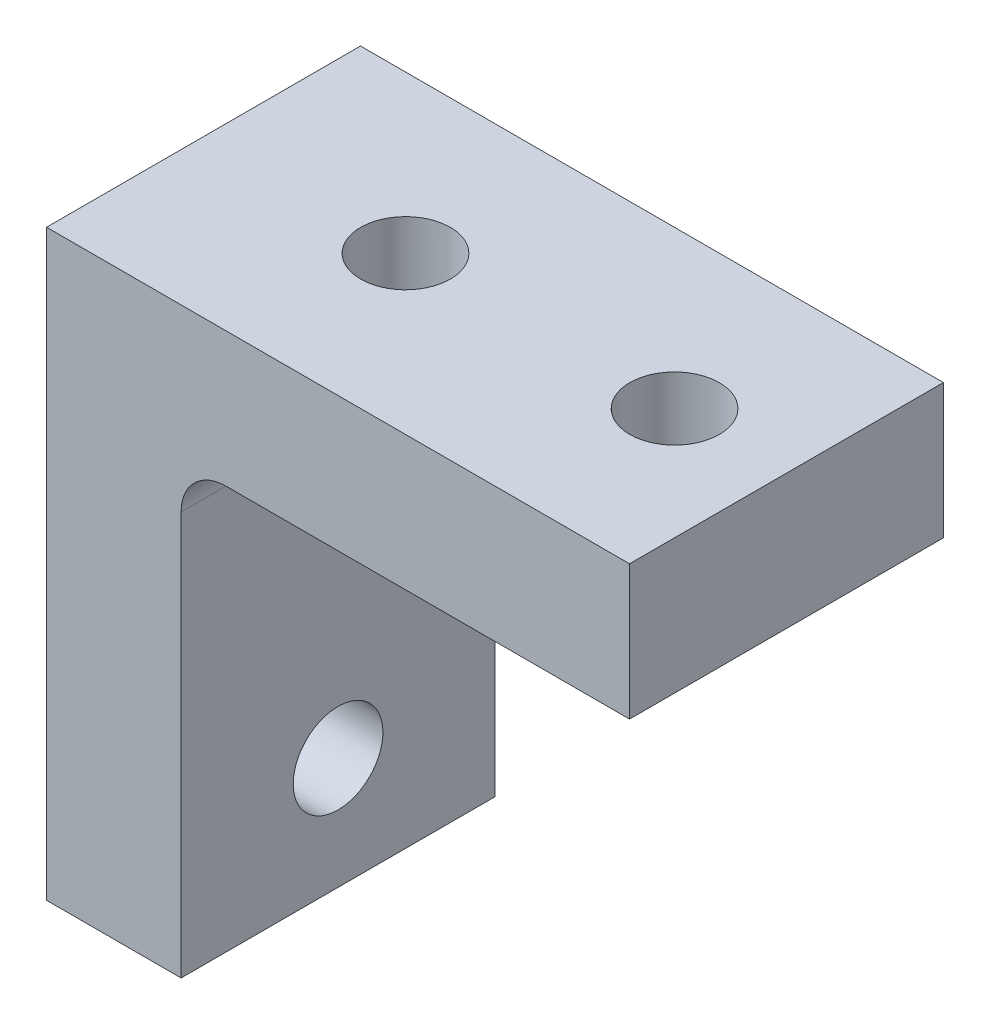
ISO-10303-21;
HEADER;
FILE_DESCRIPTION(('STEP AP214'),'2;1');
FILE_NAME('part.step','',(''),(''),'','','');
FILE_SCHEMA(('AUTOMOTIVE_DESIGN { 1 0 10303 214 1 1 1 1 }'));
ENDSEC;
DATA;
#1=APPLICATION_CONTEXT('core data for automotive mechanical design processes');
#2=APPLICATION_PROTOCOL_DEFINITION('international standard','automotive_design',2000,#1);
#3=PRODUCT_CONTEXT('',#1,'mechanical');
#4=PRODUCT('Part','Part','',(#3));
#5=PRODUCT_RELATED_PRODUCT_CATEGORY('part','',(#4));
#6=PRODUCT_DEFINITION_FORMATION('','',#4);
#7=PRODUCT_DEFINITION_CONTEXT('part definition',#1,'design');
#8=PRODUCT_DEFINITION('design','',#6,#7);
#9=PRODUCT_DEFINITION_SHAPE('','',#8);
#10=(LENGTH_UNIT() NAMED_UNIT(*) SI_UNIT(.MILLI.,.METRE.));
#11=(NAMED_UNIT(*) PLANE_ANGLE_UNIT() SI_UNIT($,.RADIAN.));
#12=(NAMED_UNIT(*) SI_UNIT($,.STERADIAN.) SOLID_ANGLE_UNIT());
#13=UNCERTAINTY_MEASURE_WITH_UNIT(LENGTH_MEASURE(1.E-05),#10,'distance_accuracy_value','');
#14=(GEOMETRIC_REPRESENTATION_CONTEXT(3) GLOBAL_UNCERTAINTY_ASSIGNED_CONTEXT((#13)) GLOBAL_UNIT_ASSIGNED_CONTEXT((#10,
#11,#12)) REPRESENTATION_CONTEXT('',''));
#15=CARTESIAN_POINT('',(0.,0.,0.));
#16=DIRECTION('',(0.,0.,1.));
#17=DIRECTION('',(1.,0.,0.));
#18=AXIS2_PLACEMENT_3D('',#15,#16,#17);
#19=CARTESIAN_POINT('',(0.,0.,11.1125));
#20=DIRECTION('',(1.,0.,0.));
#21=DIRECTION('',(0.,1.,0.));
#22=AXIS2_PLACEMENT_3D('',#19,#20,#21);
#23=PLANE('',#22);
#24=CARTESIAN_POINT('',(0.,-33.3502,0.));
#25=DIRECTION('',(-1.,0.,0.));
#26=DIRECTION('',(0.,0.,1.));
#27=AXIS2_PLACEMENT_3D('',#24,#25,#26);
#28=CIRCLE('',#27,3.17499999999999);
#29=CARTESIAN_POINT('',(0.,-33.3502,3.17499999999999));
#30=VERTEX_POINT('',#29);
#31=EDGE_CURVE('E180',#30,#30,#28,.T.);
#32=ORIENTED_EDGE('',*,*,#31,.F.);
#33=EDGE_LOOP('',(#32));
#34=FACE_BOUND('',#33,.T.);
#35=CARTESIAN_POINT('',(0.,-14.3002,0.));
#36=DIRECTION('',(-1.,0.,0.));
#37=DIRECTION('',(0.,0.,1.));
#38=AXIS2_PLACEMENT_3D('',#35,#36,#37);
#39=CIRCLE('',#38,3.17499999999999);
#40=CARTESIAN_POINT('',(0.,-14.3002,3.17499999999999));
#41=VERTEX_POINT('',#40);
#42=EDGE_CURVE('E184',#41,#41,#39,.T.);
#43=ORIENTED_EDGE('',*,*,#42,.F.);
#44=EDGE_LOOP('',(#43));
#45=FACE_BOUND('',#44,.T.);
#46=DIRECTION('',(0.,-1.,0.));
#47=VECTOR('',#46,1.);
#48=CARTESIAN_POINT('',(0.,0.,-11.1125));
#49=LINE('',#48,#47);
#50=CARTESIAN_POINT('',(0.,0.,-11.1125));
#51=VERTEX_POINT('',#50);
#52=CARTESIAN_POINT('',(0.,-41.275,-11.1125));
#53=VERTEX_POINT('',#52);
#54=EDGE_CURVE('E189',#51,#53,#49,.T.);
#55=ORIENTED_EDGE('',*,*,#54,.T.);
#56=DIRECTION('',(0.,0.,-1.));
#57=VECTOR('',#56,1.);
#58=CARTESIAN_POINT('',(0.,-41.275,11.1125));
#59=LINE('',#58,#57);
#60=CARTESIAN_POINT('',(0.,-41.275,11.1125));
#61=VERTEX_POINT('',#60);
#62=EDGE_CURVE('E122',#61,#53,#59,.T.);
#63=ORIENTED_EDGE('',*,*,#62,.F.);
#64=DIRECTION('',(0.,-1.,0.));
#65=VECTOR('',#64,1.);
#66=CARTESIAN_POINT('',(0.,0.,11.1125));
#67=LINE('',#66,#65);
#68=CARTESIAN_POINT('',(0.,0.,11.1125));
#69=VERTEX_POINT('',#68);
#70=EDGE_CURVE('E211',#69,#61,#67,.T.);
#71=ORIENTED_EDGE('',*,*,#70,.F.);
#72=DIRECTION('',(0.,0.,-1.));
#73=VECTOR('',#72,1.);
#74=CARTESIAN_POINT('',(0.,0.,11.1125));
#75=LINE('',#74,#73);
#76=EDGE_CURVE('E192',#69,#51,#75,.T.);
#77=ORIENTED_EDGE('',*,*,#76,.T.);
#78=EDGE_LOOP('',(#55,#63,#71,#77));
#79=FACE_BOUND('',#78,.T.);
#80=ADVANCED_FACE('F33',(#34,#45,#79),#23,.F.);
#81=CARTESIAN_POINT('',(0.,-41.275,11.1125));
#82=DIRECTION('',(0.,1.,0.));
#83=DIRECTION('',(0.,0.,1.));
#84=AXIS2_PLACEMENT_3D('',#81,#82,#83);
#85=PLANE('',#84);
#86=DIRECTION('',(1.,0.,0.));
#87=VECTOR('',#86,1.);
#88=CARTESIAN_POINT('',(0.,-41.275,-11.1125));
#89=LINE('',#88,#87);
#90=CARTESIAN_POINT('',(9.52500000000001,-41.275,-11.1125));
#91=VERTEX_POINT('',#90);
#92=EDGE_CURVE('E194',#53,#91,#89,.T.);
#93=ORIENTED_EDGE('',*,*,#92,.T.);
#94=DIRECTION('',(0.,0.,-1.));
#95=VECTOR('',#94,1.);
#96=CARTESIAN_POINT('',(9.52500000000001,-41.275,11.1125));
#97=LINE('',#96,#95);
#98=CARTESIAN_POINT('',(9.52500000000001,-41.275,11.1125));
#99=VERTEX_POINT('',#98);
#100=EDGE_CURVE('E126',#99,#91,#97,.T.);
#101=ORIENTED_EDGE('',*,*,#100,.F.);
#102=DIRECTION('',(1.,0.,0.));
#103=VECTOR('',#102,1.);
#104=CARTESIAN_POINT('',(0.,-41.275,11.1125));
#105=LINE('',#104,#103);
#106=EDGE_CURVE('E235',#61,#99,#105,.T.);
#107=ORIENTED_EDGE('',*,*,#106,.F.);
#108=ORIENTED_EDGE('',*,*,#62,.T.);
#109=EDGE_LOOP('',(#93,#101,#107,#108));
#110=FACE_BOUND('',#109,.T.);
#111=ADVANCED_FACE('F169',(#110),#85,.F.);
#112=CARTESIAN_POINT('',(9.52500000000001,-41.275,11.1125));
#113=DIRECTION('',(-1.,0.,0.));
#114=DIRECTION('',(0.,-1.,0.));
#115=AXIS2_PLACEMENT_3D('',#112,#113,#114);
#116=PLANE('',#115);
#117=CARTESIAN_POINT('',(9.52500000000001,-33.3502,0.));
#118=DIRECTION('',(-1.,0.,0.));
#119=DIRECTION('',(0.,-1.,0.));
#120=AXIS2_PLACEMENT_3D('',#117,#118,#119);
#121=CIRCLE('',#120,3.17499999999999);
#122=CARTESIAN_POINT('',(9.52500000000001,-36.5252,0.));
#123=VERTEX_POINT('',#122);
#124=EDGE_CURVE('E240',#123,#123,#121,.T.);
#125=ORIENTED_EDGE('',*,*,#124,.T.);
#126=EDGE_LOOP('',(#125));
#127=FACE_BOUND('',#126,.T.);
#128=DIRECTION('',(0.,0.,-1.));
#129=VECTOR('',#128,1.);
#130=CARTESIAN_POINT('',(9.525,-12.7,11.1125));
#131=LINE('',#130,#129);
#132=CARTESIAN_POINT('',(9.525,-12.7,-11.1125));
#133=VERTEX_POINT('',#132);
#134=CARTESIAN_POINT('',(9.525,-12.7,-2.74225909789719));
#135=VERTEX_POINT('',#134);
#136=EDGE_CURVE('E130',#133,#135,#131,.F.);
#137=ORIENTED_EDGE('',*,*,#136,.T.);
#138=CARTESIAN_POINT('',(9.525,-14.3002,0.));
#139=DIRECTION('',(-1.,0.,0.));
#140=DIRECTION('',(0.,-1.,0.));
#141=AXIS2_PLACEMENT_3D('',#138,#139,#140);
#142=CIRCLE('',#141,3.17499999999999);
#143=CARTESIAN_POINT('',(9.52500000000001,-12.7,2.74225909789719));
#144=VERTEX_POINT('',#143);
#145=EDGE_CURVE('E58',#135,#144,#142,.T.);
#146=ORIENTED_EDGE('',*,*,#145,.T.);
#147=CARTESIAN_POINT('',(9.525,-12.7,11.1125));
#148=VERTEX_POINT('',#147);
#149=EDGE_CURVE('E124',#144,#148,#131,.F.);
#150=ORIENTED_EDGE('',*,*,#149,.T.);
#151=DIRECTION('',(0.,1.,0.));
#152=VECTOR('',#151,1.);
#153=CARTESIAN_POINT('',(9.52500000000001,-41.275,11.1125));
#154=LINE('',#153,#152);
#155=EDGE_CURVE('E224',#99,#148,#154,.T.);
#156=ORIENTED_EDGE('',*,*,#155,.F.);
#157=ORIENTED_EDGE('',*,*,#100,.T.);
#158=DIRECTION('',(0.,1.,0.));
#159=VECTOR('',#158,1.);
#160=CARTESIAN_POINT('',(9.52500000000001,-41.275,-11.1125));
#161=LINE('',#160,#159);
#162=EDGE_CURVE('E196',#91,#133,#161,.T.);
#163=ORIENTED_EDGE('',*,*,#162,.T.);
#164=EDGE_LOOP('',(#137,#146,#150,#156,#157,#163));
#165=FACE_BOUND('',#164,.T.);
#166=ADVANCED_FACE('F165',(#127,#165),#116,.F.);
#167=CARTESIAN_POINT('',(9.525,-9.525,11.1125));
#168=DIRECTION('',(0.,1.,0.));
#169=DIRECTION('',(0.,0.,1.));
#170=AXIS2_PLACEMENT_3D('',#167,#168,#169);
#171=PLANE('',#170);
#172=CARTESIAN_POINT('',(33.3502,-9.525,0.));
#173=DIRECTION('',(0.,1.,0.));
#174=DIRECTION('',(0.,0.,1.));
#175=AXIS2_PLACEMENT_3D('',#172,#173,#174);
#176=CIRCLE('',#175,3.17499999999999);
#177=CARTESIAN_POINT('',(33.3502,-9.525,3.17499999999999));
#178=VERTEX_POINT('',#177);
#179=EDGE_CURVE('E244',#178,#178,#176,.T.);
#180=ORIENTED_EDGE('',*,*,#179,.T.);
#181=EDGE_LOOP('',(#180));
#182=FACE_BOUND('',#181,.T.);
#183=DIRECTION('',(0.,0.,-1.));
#184=VECTOR('',#183,1.);
#185=CARTESIAN_POINT('',(12.7,-9.525,-11.1125));
#186=LINE('',#185,#184);
#187=CARTESIAN_POINT('',(12.7,-9.525,11.1125));
#188=VERTEX_POINT('',#187);
#189=CARTESIAN_POINT('',(12.7,-9.525,2.7422590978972));
#190=VERTEX_POINT('',#189);
#191=EDGE_CURVE('E115',#188,#190,#186,.T.);
#192=ORIENTED_EDGE('',*,*,#191,.T.);
#193=CARTESIAN_POINT('',(14.3002,-9.525,0.));
#194=DIRECTION('',(0.,1.,0.));
#195=DIRECTION('',(0.,0.,1.));
#196=AXIS2_PLACEMENT_3D('',#193,#194,#195);
#197=CIRCLE('',#196,3.17499999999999);
#198=CARTESIAN_POINT('',(12.7,-9.525,-2.7422590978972));
#199=VERTEX_POINT('',#198);
#200=EDGE_CURVE('E52',#190,#199,#197,.T.);
#201=ORIENTED_EDGE('',*,*,#200,.T.);
#202=CARTESIAN_POINT('',(12.7,-9.525,-11.1125));
#203=VERTEX_POINT('',#202);
#204=EDGE_CURVE('E112',#199,#203,#186,.T.);
#205=ORIENTED_EDGE('',*,*,#204,.T.);
#206=DIRECTION('',(1.,0.,0.));
#207=VECTOR('',#206,1.);
#208=CARTESIAN_POINT('',(9.525,-9.525,-11.1125));
#209=LINE('',#208,#207);
#210=CARTESIAN_POINT('',(41.275,-9.525,-11.1125));
#211=VERTEX_POINT('',#210);
#212=EDGE_CURVE('E205',#203,#211,#209,.T.);
#213=ORIENTED_EDGE('',*,*,#212,.T.);
#214=DIRECTION('',(0.,0.,-1.));
#215=VECTOR('',#214,1.);
#216=CARTESIAN_POINT('',(41.275,-9.525,11.1125));
#217=LINE('',#216,#215);
#218=CARTESIAN_POINT('',(41.275,-9.525,11.1125));
#219=VERTEX_POINT('',#218);
#220=EDGE_CURVE('E216',#219,#211,#217,.T.);
#221=ORIENTED_EDGE('',*,*,#220,.F.);
#222=DIRECTION('',(1.,0.,0.));
#223=VECTOR('',#222,1.);
#224=CARTESIAN_POINT('',(9.525,-9.525,11.1125));
#225=LINE('',#224,#223);
#226=EDGE_CURVE('E231',#188,#219,#225,.T.);
#227=ORIENTED_EDGE('',*,*,#226,.F.);
#228=EDGE_LOOP('',(#192,#201,#205,#213,#221,#227));
#229=FACE_BOUND('',#228,.T.);
#230=ADVANCED_FACE('F111',(#182,#229),#171,.F.);
#231=CARTESIAN_POINT('',(41.275,-9.525,11.1125));
#232=DIRECTION('',(-1.,0.,0.));
#233=DIRECTION('',(0.,0.,1.));
#234=AXIS2_PLACEMENT_3D('',#231,#232,#233);
#235=PLANE('',#234);
#236=DIRECTION('',(0.,1.,0.));
#237=VECTOR('',#236,1.);
#238=CARTESIAN_POINT('',(41.275,-9.525,-11.1125));
#239=LINE('',#238,#237);
#240=CARTESIAN_POINT('',(41.275,0.,-11.1125));
#241=VERTEX_POINT('',#240);
#242=EDGE_CURVE('E207',#211,#241,#239,.T.);
#243=ORIENTED_EDGE('',*,*,#242,.T.);
#244=DIRECTION('',(0.,0.,-1.));
#245=VECTOR('',#244,1.);
#246=CARTESIAN_POINT('',(41.275,0.,11.1125));
#247=LINE('',#246,#245);
#248=CARTESIAN_POINT('',(41.275,0.,11.1125));
#249=VERTEX_POINT('',#248);
#250=EDGE_CURVE('E213',#249,#241,#247,.T.);
#251=ORIENTED_EDGE('',*,*,#250,.F.);
#252=DIRECTION('',(0.,1.,0.));
#253=VECTOR('',#252,1.);
#254=CARTESIAN_POINT('',(41.275,-9.525,11.1125));
#255=LINE('',#254,#253);
#256=EDGE_CURVE('E229',#219,#249,#255,.T.);
#257=ORIENTED_EDGE('',*,*,#256,.F.);
#258=ORIENTED_EDGE('',*,*,#220,.T.);
#259=EDGE_LOOP('',(#243,#251,#257,#258));
#260=FACE_BOUND('',#259,.T.);
#261=ADVANCED_FACE('F158',(#260),#235,.F.);
#262=CARTESIAN_POINT('',(41.275,0.,11.1125));
#263=DIRECTION('',(0.,-1.,0.));
#264=DIRECTION('',(1.,0.,0.));
#265=AXIS2_PLACEMENT_3D('',#262,#263,#264);
#266=PLANE('',#265);
#267=CARTESIAN_POINT('',(14.3002,0.,0.));
#268=DIRECTION('',(0.,1.,0.));
#269=DIRECTION('',(0.,0.,1.));
#270=AXIS2_PLACEMENT_3D('',#267,#268,#269);
#271=CIRCLE('',#270,3.17499999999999);
#272=CARTESIAN_POINT('',(14.3002,0.,3.17499999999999));
#273=VERTEX_POINT('',#272);
#274=EDGE_CURVE('E117',#273,#273,#271,.T.);
#275=ORIENTED_EDGE('',*,*,#274,.F.);
#276=EDGE_LOOP('',(#275));
#277=FACE_BOUND('',#276,.T.);
#278=CARTESIAN_POINT('',(33.3502,0.,0.));
#279=DIRECTION('',(0.,1.,0.));
#280=DIRECTION('',(0.,0.,1.));
#281=AXIS2_PLACEMENT_3D('',#278,#279,#280);
#282=CIRCLE('',#281,3.17499999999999);
#283=CARTESIAN_POINT('',(33.3502,0.,3.17499999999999));
#284=VERTEX_POINT('',#283);
#285=EDGE_CURVE('E116',#284,#284,#282,.T.);
#286=ORIENTED_EDGE('',*,*,#285,.F.);
#287=EDGE_LOOP('',(#286));
#288=FACE_BOUND('',#287,.T.);
#289=DIRECTION('',(-1.,0.,0.));
#290=VECTOR('',#289,1.);
#291=CARTESIAN_POINT('',(41.275,0.,-11.1125));
#292=LINE('',#291,#290);
#293=EDGE_CURVE('E209',#241,#51,#292,.T.);
#294=ORIENTED_EDGE('',*,*,#293,.T.);
#295=ORIENTED_EDGE('',*,*,#76,.F.);
#296=DIRECTION('',(-1.,0.,0.));
#297=VECTOR('',#296,1.);
#298=CARTESIAN_POINT('',(41.275,0.,11.1125));
#299=LINE('',#298,#297);
#300=EDGE_CURVE('E200',#249,#69,#299,.T.);
#301=ORIENTED_EDGE('',*,*,#300,.F.);
#302=ORIENTED_EDGE('',*,*,#250,.T.);
#303=EDGE_LOOP('',(#294,#295,#301,#302));
#304=FACE_BOUND('',#303,.T.);
#305=ADVANCED_FACE('F151',(#277,#288,#304),#266,.F.);
#306=CARTESIAN_POINT('',(0.,0.,11.1125));
#307=DIRECTION('',(0.,0.,1.));
#308=DIRECTION('',(1.,0.,0.));
#309=AXIS2_PLACEMENT_3D('',#306,#307,#308);
#310=PLANE('',#309);
#311=ORIENTED_EDGE('',*,*,#70,.T.);
#312=ORIENTED_EDGE('',*,*,#106,.T.);
#313=ORIENTED_EDGE('',*,*,#155,.T.);
#314=CARTESIAN_POINT('',(12.7,-12.7,11.1125));
#315=DIRECTION('',(0.,0.,1.));
#316=DIRECTION('',(1.,0.,0.));
#317=AXIS2_PLACEMENT_3D('',#314,#315,#316);
#318=CIRCLE('',#317,3.175);
#319=EDGE_CURVE('E134',#148,#188,#318,.F.);
#320=ORIENTED_EDGE('',*,*,#319,.T.);
#321=ORIENTED_EDGE('',*,*,#226,.T.);
#322=ORIENTED_EDGE('',*,*,#256,.T.);
#323=ORIENTED_EDGE('',*,*,#300,.T.);
#324=EDGE_LOOP('',(#311,#312,#313,#320,#321,#322,#323));
#325=FACE_BOUND('',#324,.T.);
#326=ADVANCED_FACE('F147',(#325),#310,.T.);
#327=CARTESIAN_POINT('',(0.,0.,-11.1125));
#328=DIRECTION('',(0.,0.,1.));
#329=DIRECTION('',(1.,0.,0.));
#330=AXIS2_PLACEMENT_3D('',#327,#328,#329);
#331=PLANE('',#330);
#332=ORIENTED_EDGE('',*,*,#54,.F.);
#333=ORIENTED_EDGE('',*,*,#293,.F.);
#334=ORIENTED_EDGE('',*,*,#242,.F.);
#335=ORIENTED_EDGE('',*,*,#212,.F.);
#336=CARTESIAN_POINT('',(12.7,-12.7,-11.1125));
#337=DIRECTION('',(0.,0.,1.));
#338=DIRECTION('',(1.,0.,0.));
#339=AXIS2_PLACEMENT_3D('',#336,#337,#338);
#340=CIRCLE('',#339,3.175);
#341=EDGE_CURVE('E120',#203,#133,#340,.T.);
#342=ORIENTED_EDGE('',*,*,#341,.T.);
#343=ORIENTED_EDGE('',*,*,#162,.F.);
#344=ORIENTED_EDGE('',*,*,#92,.F.);
#345=EDGE_LOOP('',(#332,#333,#334,#335,#342,#343,#344));
#346=FACE_BOUND('',#345,.T.);
#347=ADVANCED_FACE('F150',(#346),#331,.F.);
#348=CARTESIAN_POINT('',(12.7,-12.7,11.1125));
#349=DIRECTION('',(0.,0.,1.));
#350=DIRECTION('',(1.,0.,0.));
#351=AXIS2_PLACEMENT_3D('',#348,#349,#350);
#352=CYLINDRICAL_SURFACE('',#351,3.175);
#353=ORIENTED_EDGE('',*,*,#204,.F.);
#354=CARTESIAN_POINT('',(12.7,-9.525,-2.7422590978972));
#355=CARTESIAN_POINT('',(12.6265764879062,-9.5249910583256,-2.69943226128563));
#356=CARTESIAN_POINT('',(12.5549342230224,-9.52754600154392,-2.65365712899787));
#357=CARTESIAN_POINT('',(12.4158137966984,-9.53697905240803,-2.55672928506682));
#358=CARTESIAN_POINT('',(12.3483303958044,-9.54385159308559,-2.50558356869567));
#359=CARTESIAN_POINT('',(12.2183178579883,-9.56106898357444,-2.39863369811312));
#360=CARTESIAN_POINT('',(12.1557621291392,-9.57139335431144,-2.34285844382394));
#361=CARTESIAN_POINT('',(12.0354970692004,-9.59471174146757,-2.22682178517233));
#362=CARTESIAN_POINT('',(11.9777892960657,-9.6077066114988,-2.16655895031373));
#363=CARTESIAN_POINT('',(11.8128700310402,-9.64935566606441,-1.9802047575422));
#364=CARTESIAN_POINT('',(11.713161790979,-9.68078367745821,-1.84796757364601));
#365=CARTESIAN_POINT('',(11.535391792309,-9.74478928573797,-1.56966909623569));
#366=CARTESIAN_POINT('',(11.4573786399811,-9.77736928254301,-1.42357772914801));
#367=CARTESIAN_POINT('',(11.3183321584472,-9.84027269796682,-1.10539884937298));
#368=CARTESIAN_POINT('',(11.2596262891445,-9.87008496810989,-0.932160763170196));
#369=CARTESIAN_POINT('',(11.194429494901,-9.90456436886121,-0.665732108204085));
#370=CARTESIAN_POINT('',(11.1765101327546,-9.91434915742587,-0.575864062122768));
#371=CARTESIAN_POINT('',(11.1484776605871,-9.92986107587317,-0.394549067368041));
#372=CARTESIAN_POINT('',(11.1383633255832,-9.93558884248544,-0.303102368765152));
#373=CARTESIAN_POINT('',(11.1266543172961,-9.94223888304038,-0.12758863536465));
#374=CARTESIAN_POINT('',(11.1243888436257,-9.94353934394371,-0.0435795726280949));
#375=CARTESIAN_POINT('',(11.1265245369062,-9.94231942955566,0.124324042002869));
#376=CARTESIAN_POINT('',(11.1309253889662,-9.93979923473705,0.208218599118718));
#377=CARTESIAN_POINT('',(11.1463343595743,-9.93109655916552,0.37521722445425));
#378=CARTESIAN_POINT('',(11.1573433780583,-9.92491357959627,0.458321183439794));
#379=CARTESIAN_POINT('',(11.1858209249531,-9.90927511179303,0.623113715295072));
#380=CARTESIAN_POINT('',(11.2032921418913,-9.89981826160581,0.704801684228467));
#381=CARTESIAN_POINT('',(11.2626074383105,-9.86866343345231,0.937061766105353));
#382=CARTESIAN_POINT('',(11.3123887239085,-9.84350364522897,1.08521461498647));
#383=CARTESIAN_POINT('',(11.4326612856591,-9.78815686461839,1.37189275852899));
#384=CARTESIAN_POINT('',(11.5031767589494,-9.75796401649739,1.51040656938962));
#385=CARTESIAN_POINT('',(11.6744538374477,-9.6936151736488,1.79360719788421));
#386=CARTESIAN_POINT('',(11.7780079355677,-9.65947234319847,1.93661845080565));
#387=CARTESIAN_POINT('',(12.0082330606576,-9.59900648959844,2.20419955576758));
#388=CARTESIAN_POINT('',(12.1348413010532,-9.57266272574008,2.32881787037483));
#389=CARTESIAN_POINT('',(12.338419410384,-9.54493298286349,2.49792270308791));
#390=CARTESIAN_POINT('',(12.4077157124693,-9.53767196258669,2.55082871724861));
#391=CARTESIAN_POINT('',(12.5507002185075,-9.52770069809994,2.65094521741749));
#392=CARTESIAN_POINT('',(12.6243923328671,-9.52499457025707,2.69815051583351));
#393=CARTESIAN_POINT('',(12.7,-9.525,2.7422590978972));
#394=B_SPLINE_CURVE_WITH_KNOTS('',3,(#354,#355,#356,#357,#358,#359,#360,#361,#362,#363,#364,
#365,#366,#367,#368,#369,#370,#371,#372,#373,#374,#375,#376,#377,#378,#379,#380,#381,#382,#383,
#384,#385,#386,#387,#388,#389,#390,#391,#392,#393),.UNSPECIFIED.,.F.,.F.,(4,2,2,2,2,2,2,2,2,2,2,
2,2,2,2,2,2,2,2,4),(0.,0.254817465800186,0.509307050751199,0.762312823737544,1.01539959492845,
1.51885668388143,2.0234328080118,2.57610708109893,2.85222636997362,3.1283023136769,
3.38010833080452,3.6319024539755,3.88373087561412,4.13566418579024,4.60855002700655,
5.08198993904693,5.61910880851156,6.15478617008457,6.41687549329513,6.6792015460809),.UNSPECIFIED.);
#395=EDGE_CURVE('E11',#199,#190,#394,.T.);
#396=ORIENTED_EDGE('',*,*,#395,.T.);
#397=ORIENTED_EDGE('',*,*,#191,.F.);
#398=ORIENTED_EDGE('',*,*,#319,.F.);
#399=ORIENTED_EDGE('',*,*,#149,.F.);
#400=CARTESIAN_POINT('',(9.52500000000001,-12.7,2.74225909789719));
#401=CARTESIAN_POINT('',(9.52499105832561,-12.6265764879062,2.69943226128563));
#402=CARTESIAN_POINT('',(9.52754600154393,-12.5549342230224,2.65365712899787));
#403=CARTESIAN_POINT('',(9.53697905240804,-12.4158137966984,2.55672928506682));
#404=CARTESIAN_POINT('',(9.54385159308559,-12.3483303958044,2.50558356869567));
#405=CARTESIAN_POINT('',(9.56106898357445,-12.2183178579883,2.39863369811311));
#406=CARTESIAN_POINT('',(9.57139335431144,-12.1557621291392,2.34285844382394));
#407=CARTESIAN_POINT('',(9.59471174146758,-12.0354970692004,2.22682178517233));
#408=CARTESIAN_POINT('',(9.6077066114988,-11.9777892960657,2.16655895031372));
#409=CARTESIAN_POINT('',(9.64935566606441,-11.8128700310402,1.98020475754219));
#410=CARTESIAN_POINT('',(9.68078367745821,-11.713161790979,1.847967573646));
#411=CARTESIAN_POINT('',(9.74478928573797,-11.535391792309,1.56966909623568));
#412=CARTESIAN_POINT('',(9.77736928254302,-11.4573786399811,1.423577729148));
#413=CARTESIAN_POINT('',(9.84027269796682,-11.3183321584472,1.10539884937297));
#414=CARTESIAN_POINT('',(9.87008496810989,-11.2596262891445,0.932160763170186));
#415=CARTESIAN_POINT('',(9.90456436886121,-11.194429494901,0.665732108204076));
#416=CARTESIAN_POINT('',(9.91434915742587,-11.1765101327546,0.575864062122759));
#417=CARTESIAN_POINT('',(9.92986107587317,-11.1484776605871,0.394549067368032));
#418=CARTESIAN_POINT('',(9.93558884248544,-11.1383633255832,0.303102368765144));
#419=CARTESIAN_POINT('',(9.94223888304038,-11.1266543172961,0.127588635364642));
#420=CARTESIAN_POINT('',(9.94353934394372,-11.1243888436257,0.0435795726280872));
#421=CARTESIAN_POINT('',(9.94231942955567,-11.1265245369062,-0.124324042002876));
#422=CARTESIAN_POINT('',(9.93979923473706,-11.1309253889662,-0.208218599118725));
#423=CARTESIAN_POINT('',(9.93109655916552,-11.1463343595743,-0.375217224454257));
#424=CARTESIAN_POINT('',(9.92491357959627,-11.1573433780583,-0.458321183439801));
#425=CARTESIAN_POINT('',(9.90927511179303,-11.1858209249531,-0.623113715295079));
#426=CARTESIAN_POINT('',(9.89981826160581,-11.2032921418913,-0.704801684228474));
#427=CARTESIAN_POINT('',(9.86866343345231,-11.2626074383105,-0.93706176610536));
#428=CARTESIAN_POINT('',(9.84350364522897,-11.3123887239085,-1.08521461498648));
#429=CARTESIAN_POINT('',(9.78815686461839,-11.4326612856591,-1.37189275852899));
#430=CARTESIAN_POINT('',(9.75796401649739,-11.5031767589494,-1.51040656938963));
#431=CARTESIAN_POINT('',(9.6936151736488,-11.6744538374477,-1.79360719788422));
#432=CARTESIAN_POINT('',(9.65947234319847,-11.7780079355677,-1.93661845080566));
#433=CARTESIAN_POINT('',(9.59900648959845,-12.0082330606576,-2.20419955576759));
#434=CARTESIAN_POINT('',(9.57266272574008,-12.1348413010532,-2.32881787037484));
#435=CARTESIAN_POINT('',(9.54493298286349,-12.338419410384,-2.49792270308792));
#436=CARTESIAN_POINT('',(9.5376719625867,-12.4077157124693,-2.55082871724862));
#437=CARTESIAN_POINT('',(9.52770069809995,-12.5507002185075,-2.65094521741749));
#438=CARTESIAN_POINT('',(9.52499457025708,-12.624392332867,-2.69815051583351));
#439=CARTESIAN_POINT('',(9.525,-12.7,-2.74225909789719));
#440=B_SPLINE_CURVE_WITH_KNOTS('',3,(#400,#401,#402,#403,#404,#405,#406,#407,#408,#409,#410,
#411,#412,#413,#414,#415,#416,#417,#418,#419,#420,#421,#422,#423,#424,#425,#426,#427,#428,#429,
#430,#431,#432,#433,#434,#435,#436,#437,#438,#439),.UNSPECIFIED.,.F.,.F.,(4,2,2,2,2,2,2,2,2,2,2,
2,2,2,2,2,2,2,2,4),(0.,0.254817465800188,0.509307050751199,0.762312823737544,1.01539959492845,
1.51885668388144,2.0234328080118,2.57610708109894,2.85222636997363,3.1283023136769,
3.38010833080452,3.63190245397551,3.88373087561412,4.13566418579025,4.60855002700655,
5.08198993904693,5.61910880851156,6.15478617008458,6.41687549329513,6.67920154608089),.UNSPECIFIED.);
#441=EDGE_CURVE('E46',#144,#135,#440,.T.);
#442=ORIENTED_EDGE('',*,*,#441,.T.);
#443=ORIENTED_EDGE('',*,*,#136,.F.);
#444=ORIENTED_EDGE('',*,*,#341,.F.);
#445=EDGE_LOOP('',(#353,#396,#397,#398,#399,#442,#443,#444));
#446=FACE_BOUND('',#445,.T.);
#447=ADVANCED_FACE('F35',(#446),#352,.F.);
#448=CARTESIAN_POINT('',(0.,-14.3002,0.));
#449=DIRECTION('',(-1.,0.,0.));
#450=DIRECTION('',(0.,0.,1.));
#451=AXIS2_PLACEMENT_3D('',#448,#449,#450);
#452=CYLINDRICAL_SURFACE('',#451,3.17499999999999);
#453=ORIENTED_EDGE('',*,*,#42,.T.);
#454=EDGE_LOOP('',(#453));
#455=FACE_BOUND('',#454,.T.);
#456=ORIENTED_EDGE('',*,*,#441,.F.);
#457=ORIENTED_EDGE('',*,*,#145,.F.);
#458=EDGE_LOOP('',(#456,#457));
#459=FACE_BOUND('',#458,.T.);
#460=ADVANCED_FACE('F139',(#455,#459),#452,.F.);
#461=CARTESIAN_POINT('',(0.,-33.3502,0.));
#462=DIRECTION('',(-1.,0.,0.));
#463=DIRECTION('',(0.,0.,1.));
#464=AXIS2_PLACEMENT_3D('',#461,#462,#463);
#465=CYLINDRICAL_SURFACE('',#464,3.17499999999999);
#466=ORIENTED_EDGE('',*,*,#31,.T.);
#467=EDGE_LOOP('',(#466));
#468=FACE_BOUND('',#467,.T.);
#469=ORIENTED_EDGE('',*,*,#124,.F.);
#470=EDGE_LOOP('',(#469));
#471=FACE_BOUND('',#470,.T.);
#472=ADVANCED_FACE('F144',(#468,#471),#465,.F.);
#473=CARTESIAN_POINT('',(33.3502,0.,0.));
#474=DIRECTION('',(0.,1.,0.));
#475=DIRECTION('',(0.,0.,1.));
#476=AXIS2_PLACEMENT_3D('',#473,#474,#475);
#477=CYLINDRICAL_SURFACE('',#476,3.17499999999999);
#478=ORIENTED_EDGE('',*,*,#285,.T.);
#479=EDGE_LOOP('',(#478));
#480=FACE_BOUND('',#479,.T.);
#481=ORIENTED_EDGE('',*,*,#179,.F.);
#482=EDGE_LOOP('',(#481));
#483=FACE_BOUND('',#482,.T.);
#484=ADVANCED_FACE('F258',(#480,#483),#477,.F.);
#485=CARTESIAN_POINT('',(14.3002,0.,0.));
#486=DIRECTION('',(0.,1.,0.));
#487=DIRECTION('',(0.,0.,1.));
#488=AXIS2_PLACEMENT_3D('',#485,#486,#487);
#489=CYLINDRICAL_SURFACE('',#488,3.17499999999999);
#490=ORIENTED_EDGE('',*,*,#274,.T.);
#491=EDGE_LOOP('',(#490));
#492=FACE_BOUND('',#491,.T.);
#493=ORIENTED_EDGE('',*,*,#395,.F.);
#494=ORIENTED_EDGE('',*,*,#200,.F.);
#495=EDGE_LOOP('',(#493,#494));
#496=FACE_BOUND('',#495,.T.);
#497=ADVANCED_FACE('F105',(#492,#496),#489,.F.);
#498=CLOSED_SHELL('',(#80,#111,#166,#230,#261,#305,#326,#347,#447,#460,#472,#484,#497));
#499=MANIFOLD_SOLID_BREP('B2',#498);
#500=ADVANCED_BREP_SHAPE_REPRESENTATION('',(#18,#499),#14);
#501=SHAPE_DEFINITION_REPRESENTATION(#9,#500);
ENDSEC;
END-ISO-10303-21;
